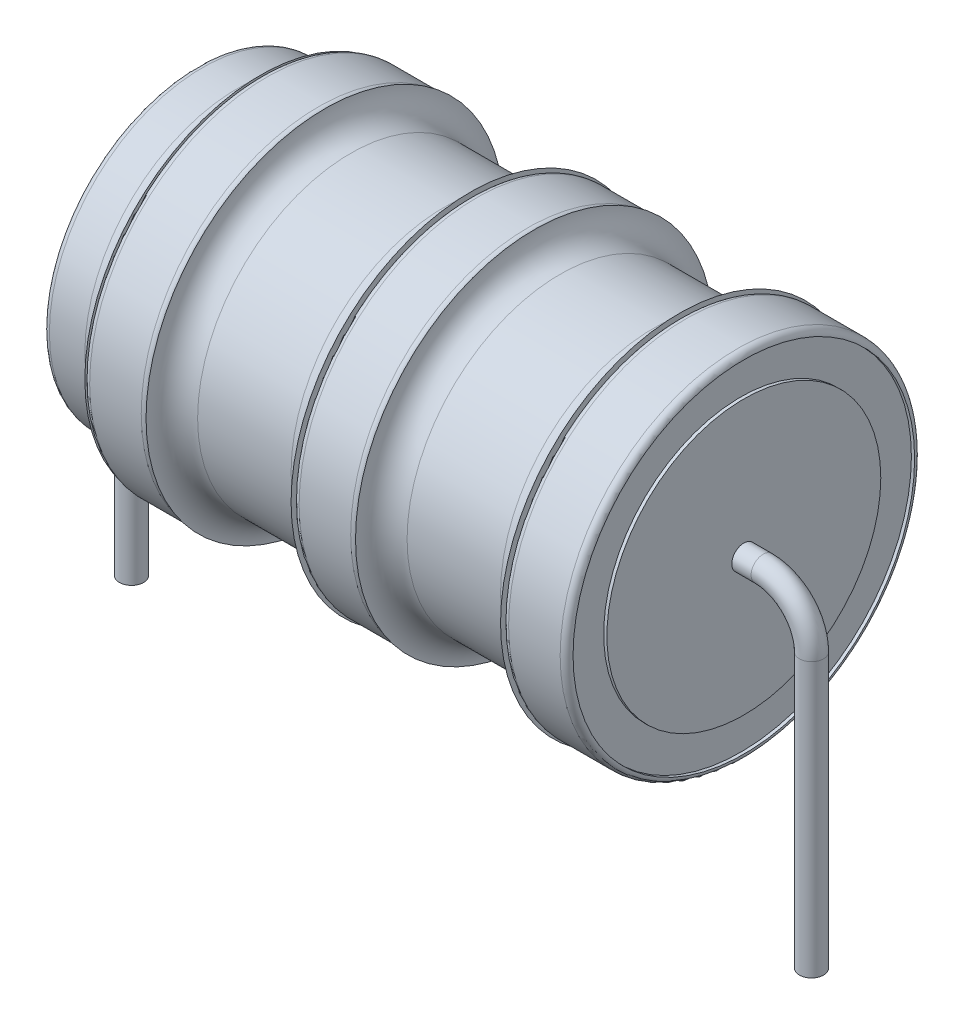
ISO-10303-21;
HEADER;
FILE_DESCRIPTION(('STEP AP214'),'2;1');
FILE_NAME('part.step','',(''),(''),'','','');
FILE_SCHEMA(('AUTOMOTIVE_DESIGN { 1 0 10303 214 1 1 1 1 }'));
ENDSEC;
DATA;
#1=APPLICATION_CONTEXT('core data for automotive mechanical design processes');
#2=APPLICATION_PROTOCOL_DEFINITION('international standard','automotive_design',2000,#1);
#3=PRODUCT_CONTEXT('',#1,'mechanical');
#4=PRODUCT('Part','Part','',(#3));
#5=PRODUCT_RELATED_PRODUCT_CATEGORY('part','',(#4));
#6=PRODUCT_DEFINITION_FORMATION('','',#4);
#7=PRODUCT_DEFINITION_CONTEXT('part definition',#1,'design');
#8=PRODUCT_DEFINITION('design','',#6,#7);
#9=PRODUCT_DEFINITION_SHAPE('','',#8);
#10=(LENGTH_UNIT() NAMED_UNIT(*) SI_UNIT(.MILLI.,.METRE.));
#11=(NAMED_UNIT(*) PLANE_ANGLE_UNIT() SI_UNIT($,.RADIAN.));
#12=(NAMED_UNIT(*) SI_UNIT($,.STERADIAN.) SOLID_ANGLE_UNIT());
#13=UNCERTAINTY_MEASURE_WITH_UNIT(LENGTH_MEASURE(1.E-05),#10,'distance_accuracy_value','');
#14=(GEOMETRIC_REPRESENTATION_CONTEXT(3) GLOBAL_UNCERTAINTY_ASSIGNED_CONTEXT((#13)) GLOBAL_UNIT_ASSIGNED_CONTEXT((#10,
#11,#12)) REPRESENTATION_CONTEXT('',''));
#15=CARTESIAN_POINT('',(0.,0.,0.));
#16=DIRECTION('',(0.,0.,1.));
#17=DIRECTION('',(1.,0.,0.));
#18=AXIS2_PLACEMENT_3D('',#15,#16,#17);
#19=CARTESIAN_POINT('',(16.8,0.,0.));
#20=DIRECTION('',(-1.,0.,0.));
#21=DIRECTION('',(0.,0.,1.));
#22=AXIS2_PLACEMENT_3D('',#19,#20,#21);
#23=TOROIDAL_SURFACE('',#22,5.3,0.199999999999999);
#24=CARTESIAN_POINT('',(16.8,0.,0.));
#25=DIRECTION('',(-1.,0.,0.));
#26=DIRECTION('',(0.,0.,1.));
#27=AXIS2_PLACEMENT_3D('',#24,#25,#26);
#28=CIRCLE('',#27,5.5);
#29=CARTESIAN_POINT('',(16.8,0.,5.5));
#30=VERTEX_POINT('',#29);
#31=EDGE_CURVE('E32',#30,#30,#28,.T.);
#32=ORIENTED_EDGE('',*,*,#31,.F.);
#33=EDGE_LOOP('',(#32));
#34=FACE_BOUND('',#33,.T.);
#35=CARTESIAN_POINT('',(17.,0.,0.));
#36=DIRECTION('',(1.,0.,0.));
#37=DIRECTION('',(0.,0.,-1.));
#38=AXIS2_PLACEMENT_3D('',#35,#36,#37);
#39=CIRCLE('',#38,5.3);
#40=CARTESIAN_POINT('',(17.,0.,-5.3));
#41=VERTEX_POINT('',#40);
#42=EDGE_CURVE('E60',#41,#41,#39,.T.);
#43=ORIENTED_EDGE('',*,*,#42,.F.);
#44=EDGE_LOOP('',(#43));
#45=FACE_BOUND('',#44,.T.);
#46=ADVANCED_FACE('F28',(#34,#45),#23,.T.);
#47=CARTESIAN_POINT('',(0.,0.,0.));
#48=DIRECTION('',(-1.,0.,0.));
#49=DIRECTION('',(0.,0.,1.));
#50=AXIS2_PLACEMENT_3D('',#47,#48,#49);
#51=CYLINDRICAL_SURFACE('',#50,5.5);
#52=CARTESIAN_POINT('',(15.2,0.,0.));
#53=DIRECTION('',(-1.,0.,0.));
#54=DIRECTION('',(0.,0.,1.));
#55=AXIS2_PLACEMENT_3D('',#52,#53,#54);
#56=CIRCLE('',#55,5.5);
#57=CARTESIAN_POINT('',(15.2,0.,5.5));
#58=VERTEX_POINT('',#57);
#59=EDGE_CURVE('E40',#58,#58,#56,.T.);
#60=ORIENTED_EDGE('',*,*,#59,.F.);
#61=EDGE_LOOP('',(#60));
#62=FACE_BOUND('',#61,.T.);
#63=ORIENTED_EDGE('',*,*,#31,.T.);
#64=EDGE_LOOP('',(#63));
#65=FACE_BOUND('',#64,.T.);
#66=ADVANCED_FACE('F139',(#62,#65),#51,.T.);
#67=CARTESIAN_POINT('',(15.2,0.,0.));
#68=DIRECTION('',(-1.,0.,0.));
#69=DIRECTION('',(0.,0.,1.));
#70=AXIS2_PLACEMENT_3D('',#67,#68,#69);
#71=TOROIDAL_SURFACE('',#70,5.3,0.2);
#72=CARTESIAN_POINT('',(15.,0.,0.));
#73=DIRECTION('',(-1.,0.,0.));
#74=DIRECTION('',(0.,0.,1.));
#75=AXIS2_PLACEMENT_3D('',#72,#73,#74);
#76=CIRCLE('',#75,5.3);
#77=CARTESIAN_POINT('',(15.,0.,5.3));
#78=VERTEX_POINT('',#77);
#79=EDGE_CURVE('E132',#78,#78,#76,.T.);
#80=ORIENTED_EDGE('',*,*,#79,.F.);
#81=EDGE_LOOP('',(#80));
#82=FACE_BOUND('',#81,.T.);
#83=ORIENTED_EDGE('',*,*,#59,.T.);
#84=EDGE_LOOP('',(#83));
#85=FACE_BOUND('',#84,.T.);
#86=ADVANCED_FACE('F137',(#82,#85),#71,.T.);
#87=CARTESIAN_POINT('',(15.,5.55,0.));
#88=DIRECTION('',(-1.,0.,0.));
#89=DIRECTION('',(0.,0.,1.));
#90=AXIS2_PLACEMENT_3D('',#87,#88,#89);
#91=PLANE('',#90);
#92=CARTESIAN_POINT('',(15.,0.,0.));
#93=DIRECTION('',(-1.,0.,0.));
#94=DIRECTION('',(0.,0.,1.));
#95=AXIS2_PLACEMENT_3D('',#92,#93,#94);
#96=CIRCLE('',#95,5.55);
#97=CARTESIAN_POINT('',(15.,0.,5.55));
#98=VERTEX_POINT('',#97);
#99=EDGE_CURVE('E129',#98,#98,#96,.T.);
#100=ORIENTED_EDGE('',*,*,#99,.F.);
#101=EDGE_LOOP('',(#100));
#102=FACE_BOUND('',#101,.T.);
#103=ORIENTED_EDGE('',*,*,#79,.T.);
#104=EDGE_LOOP('',(#103));
#105=FACE_BOUND('',#104,.T.);
#106=ADVANCED_FACE('F250',(#102,#105),#91,.F.);
#107=CARTESIAN_POINT('',(14.2,0.,0.));
#108=DIRECTION('',(-1.,0.,0.));
#109=DIRECTION('',(0.,0.,1.));
#110=AXIS2_PLACEMENT_3D('',#107,#108,#109);
#111=TOROIDAL_SURFACE('',#110,5.55,0.800000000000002);
#112=CARTESIAN_POINT('',(14.2,0.,0.));
#113=DIRECTION('',(-1.,0.,0.));
#114=DIRECTION('',(0.,0.,1.));
#115=AXIS2_PLACEMENT_3D('',#112,#113,#114);
#116=CIRCLE('',#115,4.75);
#117=CARTESIAN_POINT('',(14.2,0.,4.75));
#118=VERTEX_POINT('',#117);
#119=EDGE_CURVE('E126',#118,#118,#116,.T.);
#120=ORIENTED_EDGE('',*,*,#119,.F.);
#121=EDGE_LOOP('',(#120));
#122=FACE_BOUND('',#121,.T.);
#123=ORIENTED_EDGE('',*,*,#99,.T.);
#124=EDGE_LOOP('',(#123));
#125=FACE_BOUND('',#124,.T.);
#126=ADVANCED_FACE('F246',(#122,#125),#111,.F.);
#127=CARTESIAN_POINT('',(0.,0.,0.));
#128=DIRECTION('',(-1.,0.,0.));
#129=DIRECTION('',(0.,0.,1.));
#130=AXIS2_PLACEMENT_3D('',#127,#128,#129);
#131=CYLINDRICAL_SURFACE('',#130,4.75);
#132=CARTESIAN_POINT('',(11.3,0.,0.));
#133=DIRECTION('',(-1.,0.,0.));
#134=DIRECTION('',(0.,0.,1.));
#135=AXIS2_PLACEMENT_3D('',#132,#133,#134);
#136=CIRCLE('',#135,4.75);
#137=CARTESIAN_POINT('',(11.3,0.,4.75));
#138=VERTEX_POINT('',#137);
#139=EDGE_CURVE('E123',#138,#138,#136,.T.);
#140=ORIENTED_EDGE('',*,*,#139,.F.);
#141=EDGE_LOOP('',(#140));
#142=FACE_BOUND('',#141,.T.);
#143=ORIENTED_EDGE('',*,*,#119,.T.);
#144=EDGE_LOOP('',(#143));
#145=FACE_BOUND('',#144,.T.);
#146=ADVANCED_FACE('F242',(#142,#145),#131,.T.);
#147=CARTESIAN_POINT('',(11.3,0.,0.));
#148=DIRECTION('',(-1.,0.,0.));
#149=DIRECTION('',(0.,0.,1.));
#150=AXIS2_PLACEMENT_3D('',#147,#148,#149);
#151=TOROIDAL_SURFACE('',#150,5.55,0.8);
#152=CARTESIAN_POINT('',(10.5,0.,0.));
#153=DIRECTION('',(-1.,0.,0.));
#154=DIRECTION('',(0.,0.,1.));
#155=AXIS2_PLACEMENT_3D('',#152,#153,#154);
#156=CIRCLE('',#155,5.55);
#157=CARTESIAN_POINT('',(10.5,0.,5.55));
#158=VERTEX_POINT('',#157);
#159=EDGE_CURVE('E120',#158,#158,#156,.T.);
#160=ORIENTED_EDGE('',*,*,#159,.F.);
#161=EDGE_LOOP('',(#160));
#162=FACE_BOUND('',#161,.T.);
#163=ORIENTED_EDGE('',*,*,#139,.T.);
#164=EDGE_LOOP('',(#163));
#165=FACE_BOUND('',#164,.T.);
#166=ADVANCED_FACE('F238',(#162,#165),#151,.F.);
#167=CARTESIAN_POINT('',(10.5,5.3,0.));
#168=DIRECTION('',(1.,0.,0.));
#169=DIRECTION('',(0.,0.,-1.));
#170=AXIS2_PLACEMENT_3D('',#167,#168,#169);
#171=PLANE('',#170);
#172=CARTESIAN_POINT('',(10.5,0.,0.));
#173=DIRECTION('',(-1.,0.,0.));
#174=DIRECTION('',(0.,0.,1.));
#175=AXIS2_PLACEMENT_3D('',#172,#173,#174);
#176=CIRCLE('',#175,5.3);
#177=CARTESIAN_POINT('',(10.5,0.,5.3));
#178=VERTEX_POINT('',#177);
#179=EDGE_CURVE('E117',#178,#178,#176,.T.);
#180=ORIENTED_EDGE('',*,*,#179,.F.);
#181=EDGE_LOOP('',(#180));
#182=FACE_BOUND('',#181,.T.);
#183=ORIENTED_EDGE('',*,*,#159,.T.);
#184=EDGE_LOOP('',(#183));
#185=FACE_BOUND('',#184,.T.);
#186=ADVANCED_FACE('F234',(#182,#185),#171,.F.);
#187=CARTESIAN_POINT('',(10.3,0.,0.));
#188=DIRECTION('',(-1.,0.,0.));
#189=DIRECTION('',(0.,0.,1.));
#190=AXIS2_PLACEMENT_3D('',#187,#188,#189);
#191=TOROIDAL_SURFACE('',#190,5.3,0.199999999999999);
#192=CARTESIAN_POINT('',(10.3,0.,0.));
#193=DIRECTION('',(-1.,0.,0.));
#194=DIRECTION('',(0.,0.,1.));
#195=AXIS2_PLACEMENT_3D('',#192,#193,#194);
#196=CIRCLE('',#195,5.5);
#197=CARTESIAN_POINT('',(10.3,0.,5.5));
#198=VERTEX_POINT('',#197);
#199=EDGE_CURVE('E114',#198,#198,#196,.T.);
#200=ORIENTED_EDGE('',*,*,#199,.F.);
#201=EDGE_LOOP('',(#200));
#202=FACE_BOUND('',#201,.T.);
#203=ORIENTED_EDGE('',*,*,#179,.T.);
#204=EDGE_LOOP('',(#203));
#205=FACE_BOUND('',#204,.T.);
#206=ADVANCED_FACE('F230',(#202,#205),#191,.T.);
#207=CARTESIAN_POINT('',(0.,0.,0.));
#208=DIRECTION('',(-1.,0.,0.));
#209=DIRECTION('',(0.,0.,1.));
#210=AXIS2_PLACEMENT_3D('',#207,#208,#209);
#211=CYLINDRICAL_SURFACE('',#210,5.5);
#212=CARTESIAN_POINT('',(8.7,0.,0.));
#213=DIRECTION('',(-1.,0.,0.));
#214=DIRECTION('',(0.,0.,1.));
#215=AXIS2_PLACEMENT_3D('',#212,#213,#214);
#216=CIRCLE('',#215,5.5);
#217=CARTESIAN_POINT('',(8.7,0.,5.5));
#218=VERTEX_POINT('',#217);
#219=EDGE_CURVE('E111',#218,#218,#216,.T.);
#220=ORIENTED_EDGE('',*,*,#219,.F.);
#221=EDGE_LOOP('',(#220));
#222=FACE_BOUND('',#221,.T.);
#223=ORIENTED_EDGE('',*,*,#199,.T.);
#224=EDGE_LOOP('',(#223));
#225=FACE_BOUND('',#224,.T.);
#226=ADVANCED_FACE('F226',(#222,#225),#211,.T.);
#227=CARTESIAN_POINT('',(8.7,0.,0.));
#228=DIRECTION('',(-1.,0.,0.));
#229=DIRECTION('',(0.,0.,1.));
#230=AXIS2_PLACEMENT_3D('',#227,#228,#229);
#231=TOROIDAL_SURFACE('',#230,5.3,0.2);
#232=CARTESIAN_POINT('',(8.5,0.,0.));
#233=DIRECTION('',(-1.,0.,0.));
#234=DIRECTION('',(0.,0.,1.));
#235=AXIS2_PLACEMENT_3D('',#232,#233,#234);
#236=CIRCLE('',#235,5.3);
#237=CARTESIAN_POINT('',(8.5,0.,5.3));
#238=VERTEX_POINT('',#237);
#239=EDGE_CURVE('E108',#238,#238,#236,.T.);
#240=ORIENTED_EDGE('',*,*,#239,.F.);
#241=EDGE_LOOP('',(#240));
#242=FACE_BOUND('',#241,.T.);
#243=ORIENTED_EDGE('',*,*,#219,.T.);
#244=EDGE_LOOP('',(#243));
#245=FACE_BOUND('',#244,.T.);
#246=ADVANCED_FACE('F222',(#242,#245),#231,.T.);
#247=CARTESIAN_POINT('',(8.5,5.55,0.));
#248=DIRECTION('',(-1.,0.,0.));
#249=DIRECTION('',(0.,0.,1.));
#250=AXIS2_PLACEMENT_3D('',#247,#248,#249);
#251=PLANE('',#250);
#252=CARTESIAN_POINT('',(8.5,0.,0.));
#253=DIRECTION('',(-1.,0.,0.));
#254=DIRECTION('',(0.,0.,1.));
#255=AXIS2_PLACEMENT_3D('',#252,#253,#254);
#256=CIRCLE('',#255,5.55);
#257=CARTESIAN_POINT('',(8.5,0.,5.55));
#258=VERTEX_POINT('',#257);
#259=EDGE_CURVE('E105',#258,#258,#256,.T.);
#260=ORIENTED_EDGE('',*,*,#259,.F.);
#261=EDGE_LOOP('',(#260));
#262=FACE_BOUND('',#261,.T.);
#263=ORIENTED_EDGE('',*,*,#239,.T.);
#264=EDGE_LOOP('',(#263));
#265=FACE_BOUND('',#264,.T.);
#266=ADVANCED_FACE('F218',(#262,#265),#251,.F.);
#267=CARTESIAN_POINT('',(7.7,0.,0.));
#268=DIRECTION('',(-1.,0.,0.));
#269=DIRECTION('',(0.,0.,1.));
#270=AXIS2_PLACEMENT_3D('',#267,#268,#269);
#271=TOROIDAL_SURFACE('',#270,5.55,0.8);
#272=CARTESIAN_POINT('',(7.7,0.,0.));
#273=DIRECTION('',(-1.,0.,0.));
#274=DIRECTION('',(0.,0.,1.));
#275=AXIS2_PLACEMENT_3D('',#272,#273,#274);
#276=CIRCLE('',#275,4.75);
#277=CARTESIAN_POINT('',(7.7,0.,4.75));
#278=VERTEX_POINT('',#277);
#279=EDGE_CURVE('E102',#278,#278,#276,.T.);
#280=ORIENTED_EDGE('',*,*,#279,.F.);
#281=EDGE_LOOP('',(#280));
#282=FACE_BOUND('',#281,.T.);
#283=ORIENTED_EDGE('',*,*,#259,.T.);
#284=EDGE_LOOP('',(#283));
#285=FACE_BOUND('',#284,.T.);
#286=ADVANCED_FACE('F214',(#282,#285),#271,.F.);
#287=CARTESIAN_POINT('',(0.,0.,0.));
#288=DIRECTION('',(-1.,0.,0.));
#289=DIRECTION('',(0.,0.,1.));
#290=AXIS2_PLACEMENT_3D('',#287,#288,#289);
#291=CYLINDRICAL_SURFACE('',#290,4.75);
#292=CARTESIAN_POINT('',(4.8,0.,0.));
#293=DIRECTION('',(-1.,0.,0.));
#294=DIRECTION('',(0.,0.,1.));
#295=AXIS2_PLACEMENT_3D('',#292,#293,#294);
#296=CIRCLE('',#295,4.75);
#297=CARTESIAN_POINT('',(4.8,0.,4.75));
#298=VERTEX_POINT('',#297);
#299=EDGE_CURVE('E99',#298,#298,#296,.T.);
#300=ORIENTED_EDGE('',*,*,#299,.F.);
#301=EDGE_LOOP('',(#300));
#302=FACE_BOUND('',#301,.T.);
#303=ORIENTED_EDGE('',*,*,#279,.T.);
#304=EDGE_LOOP('',(#303));
#305=FACE_BOUND('',#304,.T.);
#306=ADVANCED_FACE('F210',(#302,#305),#291,.T.);
#307=CARTESIAN_POINT('',(4.8,0.,0.));
#308=DIRECTION('',(-1.,0.,0.));
#309=DIRECTION('',(0.,0.,1.));
#310=AXIS2_PLACEMENT_3D('',#307,#308,#309);
#311=TOROIDAL_SURFACE('',#310,5.55,0.8);
#312=CARTESIAN_POINT('',(4.,0.,0.));
#313=DIRECTION('',(-1.,0.,0.));
#314=DIRECTION('',(0.,0.,1.));
#315=AXIS2_PLACEMENT_3D('',#312,#313,#314);
#316=CIRCLE('',#315,5.55);
#317=CARTESIAN_POINT('',(4.,0.,5.55));
#318=VERTEX_POINT('',#317);
#319=EDGE_CURVE('E96',#318,#318,#316,.T.);
#320=ORIENTED_EDGE('',*,*,#319,.F.);
#321=EDGE_LOOP('',(#320));
#322=FACE_BOUND('',#321,.T.);
#323=ORIENTED_EDGE('',*,*,#299,.T.);
#324=EDGE_LOOP('',(#323));
#325=FACE_BOUND('',#324,.T.);
#326=ADVANCED_FACE('F206',(#322,#325),#311,.F.);
#327=CARTESIAN_POINT('',(4.,5.3,0.));
#328=DIRECTION('',(1.,0.,0.));
#329=DIRECTION('',(0.,0.,-1.));
#330=AXIS2_PLACEMENT_3D('',#327,#328,#329);
#331=PLANE('',#330);
#332=CARTESIAN_POINT('',(4.,0.,0.));
#333=DIRECTION('',(-1.,0.,0.));
#334=DIRECTION('',(0.,0.,1.));
#335=AXIS2_PLACEMENT_3D('',#332,#333,#334);
#336=CIRCLE('',#335,5.3);
#337=CARTESIAN_POINT('',(4.,0.,5.3));
#338=VERTEX_POINT('',#337);
#339=EDGE_CURVE('E93',#338,#338,#336,.T.);
#340=ORIENTED_EDGE('',*,*,#339,.F.);
#341=EDGE_LOOP('',(#340));
#342=FACE_BOUND('',#341,.T.);
#343=ORIENTED_EDGE('',*,*,#319,.T.);
#344=EDGE_LOOP('',(#343));
#345=FACE_BOUND('',#344,.T.);
#346=ADVANCED_FACE('F202',(#342,#345),#331,.F.);
#347=CARTESIAN_POINT('',(3.8,0.,0.));
#348=DIRECTION('',(-1.,0.,0.));
#349=DIRECTION('',(0.,0.,1.));
#350=AXIS2_PLACEMENT_3D('',#347,#348,#349);
#351=TOROIDAL_SURFACE('',#350,5.3,0.2);
#352=CARTESIAN_POINT('',(3.8,0.,0.));
#353=DIRECTION('',(-1.,0.,0.));
#354=DIRECTION('',(0.,0.,1.));
#355=AXIS2_PLACEMENT_3D('',#352,#353,#354);
#356=CIRCLE('',#355,5.5);
#357=CARTESIAN_POINT('',(3.8,0.,5.5));
#358=VERTEX_POINT('',#357);
#359=EDGE_CURVE('E90',#358,#358,#356,.T.);
#360=ORIENTED_EDGE('',*,*,#359,.F.);
#361=EDGE_LOOP('',(#360));
#362=FACE_BOUND('',#361,.T.);
#363=ORIENTED_EDGE('',*,*,#339,.T.);
#364=EDGE_LOOP('',(#363));
#365=FACE_BOUND('',#364,.T.);
#366=ADVANCED_FACE('F198',(#362,#365),#351,.T.);
#367=CARTESIAN_POINT('',(0.,0.,0.));
#368=DIRECTION('',(-1.,0.,0.));
#369=DIRECTION('',(0.,0.,1.));
#370=AXIS2_PLACEMENT_3D('',#367,#368,#369);
#371=CYLINDRICAL_SURFACE('',#370,5.5);
#372=CARTESIAN_POINT('',(2.2,0.,0.));
#373=DIRECTION('',(-1.,0.,0.));
#374=DIRECTION('',(0.,0.,1.));
#375=AXIS2_PLACEMENT_3D('',#372,#373,#374);
#376=CIRCLE('',#375,5.5);
#377=CARTESIAN_POINT('',(2.2,0.,5.5));
#378=VERTEX_POINT('',#377);
#379=EDGE_CURVE('E87',#378,#378,#376,.T.);
#380=ORIENTED_EDGE('',*,*,#379,.F.);
#381=EDGE_LOOP('',(#380));
#382=FACE_BOUND('',#381,.T.);
#383=ORIENTED_EDGE('',*,*,#359,.T.);
#384=EDGE_LOOP('',(#383));
#385=FACE_BOUND('',#384,.T.);
#386=ADVANCED_FACE('F194',(#382,#385),#371,.T.);
#387=CARTESIAN_POINT('',(2.2,0.,0.));
#388=DIRECTION('',(-1.,0.,0.));
#389=DIRECTION('',(0.,0.,1.));
#390=AXIS2_PLACEMENT_3D('',#387,#388,#389);
#391=TOROIDAL_SURFACE('',#390,5.3,0.2);
#392=CARTESIAN_POINT('',(2.,0.,0.));
#393=DIRECTION('',(-1.,0.,0.));
#394=DIRECTION('',(0.,0.,1.));
#395=AXIS2_PLACEMENT_3D('',#392,#393,#394);
#396=CIRCLE('',#395,5.3);
#397=CARTESIAN_POINT('',(2.,0.,5.3));
#398=VERTEX_POINT('',#397);
#399=EDGE_CURVE('E84',#398,#398,#396,.T.);
#400=ORIENTED_EDGE('',*,*,#399,.F.);
#401=EDGE_LOOP('',(#400));
#402=FACE_BOUND('',#401,.T.);
#403=ORIENTED_EDGE('',*,*,#379,.T.);
#404=EDGE_LOOP('',(#403));
#405=FACE_BOUND('',#404,.T.);
#406=ADVANCED_FACE('F190',(#402,#405),#391,.T.);
#407=CARTESIAN_POINT('',(2.,5.45,0.));
#408=DIRECTION('',(-1.,0.,0.));
#409=DIRECTION('',(0.,0.,1.));
#410=AXIS2_PLACEMENT_3D('',#407,#408,#409);
#411=PLANE('',#410);
#412=CARTESIAN_POINT('',(2.,0.,0.));
#413=DIRECTION('',(-1.,0.,0.));
#414=DIRECTION('',(0.,0.,1.));
#415=AXIS2_PLACEMENT_3D('',#412,#413,#414);
#416=CIRCLE('',#415,5.45);
#417=CARTESIAN_POINT('',(2.,0.,5.45));
#418=VERTEX_POINT('',#417);
#419=EDGE_CURVE('E81',#418,#418,#416,.T.);
#420=ORIENTED_EDGE('',*,*,#419,.F.);
#421=EDGE_LOOP('',(#420));
#422=FACE_BOUND('',#421,.T.);
#423=ORIENTED_EDGE('',*,*,#399,.T.);
#424=EDGE_LOOP('',(#423));
#425=FACE_BOUND('',#424,.T.);
#426=ADVANCED_FACE('F186',(#422,#425),#411,.F.);
#427=CARTESIAN_POINT('',(1.3,0.,0.));
#428=DIRECTION('',(-1.,0.,0.));
#429=DIRECTION('',(0.,0.,1.));
#430=AXIS2_PLACEMENT_3D('',#427,#428,#429);
#431=TOROIDAL_SURFACE('',#430,5.45,0.7);
#432=CARTESIAN_POINT('',(1.3,0.,0.));
#433=DIRECTION('',(-1.,0.,0.));
#434=DIRECTION('',(0.,0.,1.));
#435=AXIS2_PLACEMENT_3D('',#432,#433,#434);
#436=CIRCLE('',#435,4.75);
#437=CARTESIAN_POINT('',(1.3,0.,4.75));
#438=VERTEX_POINT('',#437);
#439=EDGE_CURVE('E78',#438,#438,#436,.T.);
#440=ORIENTED_EDGE('',*,*,#439,.F.);
#441=EDGE_LOOP('',(#440));
#442=FACE_BOUND('',#441,.T.);
#443=ORIENTED_EDGE('',*,*,#419,.T.);
#444=EDGE_LOOP('',(#443));
#445=FACE_BOUND('',#444,.T.);
#446=ADVANCED_FACE('F182',(#442,#445),#431,.F.);
#447=CARTESIAN_POINT('',(0.,0.,0.));
#448=DIRECTION('',(-1.,0.,0.));
#449=DIRECTION('',(0.,0.,1.));
#450=AXIS2_PLACEMENT_3D('',#447,#448,#449);
#451=CYLINDRICAL_SURFACE('',#450,4.75);
#452=CARTESIAN_POINT('',(0.2,0.,0.));
#453=DIRECTION('',(-1.,0.,0.));
#454=DIRECTION('',(0.,0.,1.));
#455=AXIS2_PLACEMENT_3D('',#452,#453,#454);
#456=CIRCLE('',#455,4.75);
#457=CARTESIAN_POINT('',(0.2,0.,4.75));
#458=VERTEX_POINT('',#457);
#459=EDGE_CURVE('E75',#458,#458,#456,.T.);
#460=ORIENTED_EDGE('',*,*,#459,.F.);
#461=EDGE_LOOP('',(#460));
#462=FACE_BOUND('',#461,.T.);
#463=ORIENTED_EDGE('',*,*,#439,.T.);
#464=EDGE_LOOP('',(#463));
#465=FACE_BOUND('',#464,.T.);
#466=ADVANCED_FACE('F178',(#462,#465),#451,.T.);
#467=CARTESIAN_POINT('',(0.2,0.,0.));
#468=DIRECTION('',(-1.,0.,0.));
#469=DIRECTION('',(0.,0.,1.));
#470=AXIS2_PLACEMENT_3D('',#467,#468,#469);
#471=TOROIDAL_SURFACE('',#470,4.55,0.2);
#472=CARTESIAN_POINT('',(0.,0.,0.));
#473=DIRECTION('',(-1.,0.,0.));
#474=DIRECTION('',(0.,0.,1.));
#475=AXIS2_PLACEMENT_3D('',#472,#473,#474);
#476=CIRCLE('',#475,4.55);
#477=CARTESIAN_POINT('',(0.,0.,4.55));
#478=VERTEX_POINT('',#477);
#479=EDGE_CURVE('E72',#478,#478,#476,.T.);
#480=ORIENTED_EDGE('',*,*,#479,.F.);
#481=EDGE_LOOP('',(#480));
#482=FACE_BOUND('',#481,.T.);
#483=ORIENTED_EDGE('',*,*,#459,.T.);
#484=EDGE_LOOP('',(#483));
#485=FACE_BOUND('',#484,.T.);
#486=ADVANCED_FACE('F174',(#482,#485),#471,.T.);
#487=CARTESIAN_POINT('',(0.,0.,0.));
#488=DIRECTION('',(1.,0.,0.));
#489=DIRECTION('',(0.,0.,-1.));
#490=AXIS2_PLACEMENT_3D('',#487,#488,#489);
#491=PLANE('',#490);
#492=CARTESIAN_POINT('',(0.,0.,0.));
#493=DIRECTION('',(-1.,0.,0.));
#494=DIRECTION('',(0.,0.,1.));
#495=AXIS2_PLACEMENT_3D('',#492,#493,#494);
#496=CIRCLE('',#495,4.25);
#497=CARTESIAN_POINT('',(0.,0.,4.25));
#498=VERTEX_POINT('',#497);
#499=EDGE_CURVE('E66',#498,#498,#496,.T.);
#500=ORIENTED_EDGE('',*,*,#499,.F.);
#501=EDGE_LOOP('',(#500));
#502=FACE_BOUND('',#501,.T.);
#503=ORIENTED_EDGE('',*,*,#479,.T.);
#504=EDGE_LOOP('',(#503));
#505=FACE_BOUND('',#504,.T.);
#506=ADVANCED_FACE('F170',(#502,#505),#491,.F.);
#507=CARTESIAN_POINT('',(0.1,0.,0.));
#508=DIRECTION('',(-1.,0.,0.));
#509=DIRECTION('',(0.,0.,1.));
#510=AXIS2_PLACEMENT_3D('',#507,#508,#509);
#511=CYLINDRICAL_SURFACE('',#510,4.25);
#512=CARTESIAN_POINT('',(0.1,0.,0.));
#513=DIRECTION('',(-1.,0.,0.));
#514=DIRECTION('',(0.,0.,1.));
#515=AXIS2_PLACEMENT_3D('',#512,#513,#514);
#516=CIRCLE('',#515,4.25);
#517=CARTESIAN_POINT('',(0.1,0.,4.25));
#518=VERTEX_POINT('',#517);
#519=EDGE_CURVE('E69',#518,#518,#516,.T.);
#520=ORIENTED_EDGE('',*,*,#519,.F.);
#521=EDGE_LOOP('',(#520));
#522=FACE_BOUND('',#521,.T.);
#523=ORIENTED_EDGE('',*,*,#499,.T.);
#524=EDGE_LOOP('',(#523));
#525=FACE_BOUND('',#524,.T.);
#526=ADVANCED_FACE('F162',(#522,#525),#511,.F.);
#527=CARTESIAN_POINT('',(0.1,0.,0.));
#528=DIRECTION('',(-1.,0.,0.));
#529=DIRECTION('',(0.,0.,1.));
#530=AXIS2_PLACEMENT_3D('',#527,#528,#529);
#531=PLANE('',#530);
#532=CARTESIAN_POINT('',(0.1,0.,0.));
#533=DIRECTION('',(-1.,0.,0.));
#534=DIRECTION('',(0.,0.,1.));
#535=AXIS2_PLACEMENT_3D('',#532,#533,#534);
#536=CIRCLE('',#535,0.375);
#537=CARTESIAN_POINT('',(0.1,0.,0.375));
#538=VERTEX_POINT('',#537);
#539=EDGE_CURVE('E10',#538,#538,#536,.T.);
#540=ORIENTED_EDGE('',*,*,#539,.F.);
#541=EDGE_LOOP('',(#540));
#542=FACE_BOUND('',#541,.T.);
#543=ORIENTED_EDGE('',*,*,#519,.T.);
#544=EDGE_LOOP('',(#543));
#545=FACE_BOUND('',#544,.T.);
#546=ADVANCED_FACE('F152',(#542,#545),#531,.T.);
#547=CARTESIAN_POINT('',(16.9,0.,0.));
#548=DIRECTION('',(1.,0.,0.));
#549=DIRECTION('',(0.,0.,-1.));
#550=AXIS2_PLACEMENT_3D('',#547,#548,#549);
#551=CYLINDRICAL_SURFACE('',#550,5.3);
#552=CARTESIAN_POINT('',(16.9,0.,0.));
#553=DIRECTION('',(1.,0.,0.));
#554=DIRECTION('',(0.,0.,-1.));
#555=AXIS2_PLACEMENT_3D('',#552,#553,#554);
#556=CIRCLE('',#555,5.3);
#557=CARTESIAN_POINT('',(16.9,0.,-5.3));
#558=VERTEX_POINT('',#557);
#559=EDGE_CURVE('E63',#558,#558,#556,.T.);
#560=ORIENTED_EDGE('',*,*,#559,.F.);
#561=EDGE_LOOP('',(#560));
#562=FACE_BOUND('',#561,.T.);
#563=ORIENTED_EDGE('',*,*,#42,.T.);
#564=EDGE_LOOP('',(#563));
#565=FACE_BOUND('',#564,.T.);
#566=ADVANCED_FACE('F149',(#562,#565),#551,.F.);
#567=CARTESIAN_POINT('',(16.9,0.,0.));
#568=DIRECTION('',(1.,0.,0.));
#569=DIRECTION('',(0.,0.,-1.));
#570=AXIS2_PLACEMENT_3D('',#567,#568,#569);
#571=PLANE('',#570);
#572=CARTESIAN_POINT('',(16.9,0.,0.));
#573=DIRECTION('',(1.,0.,0.));
#574=DIRECTION('',(0.,0.,-1.));
#575=AXIS2_PLACEMENT_3D('',#572,#573,#574);
#576=CIRCLE('',#575,4.25);
#577=CARTESIAN_POINT('',(16.9,0.,-4.25));
#578=VERTEX_POINT('',#577);
#579=EDGE_CURVE('E57',#578,#578,#576,.T.);
#580=ORIENTED_EDGE('',*,*,#579,.F.);
#581=EDGE_LOOP('',(#580));
#582=FACE_BOUND('',#581,.T.);
#583=ORIENTED_EDGE('',*,*,#559,.T.);
#584=EDGE_LOOP('',(#583));
#585=FACE_BOUND('',#584,.T.);
#586=ADVANCED_FACE('F151',(#582,#585),#571,.T.);
#587=CARTESIAN_POINT('',(16.9,0.,0.));
#588=DIRECTION('',(1.,0.,0.));
#589=DIRECTION('',(0.,0.,-1.));
#590=AXIS2_PLACEMENT_3D('',#587,#588,#589);
#591=CYLINDRICAL_SURFACE('',#590,4.25);
#592=ORIENTED_EDGE('',*,*,#579,.T.);
#593=EDGE_LOOP('',(#592));
#594=FACE_BOUND('',#593,.T.);
#595=CARTESIAN_POINT('',(17.,0.,0.));
#596=DIRECTION('',(1.,0.,0.));
#597=DIRECTION('',(0.,0.,-1.));
#598=AXIS2_PLACEMENT_3D('',#595,#596,#597);
#599=CIRCLE('',#598,4.25);
#600=CARTESIAN_POINT('',(17.,0.,-4.25));
#601=VERTEX_POINT('',#600);
#602=EDGE_CURVE('E54',#601,#601,#599,.T.);
#603=ORIENTED_EDGE('',*,*,#602,.F.);
#604=EDGE_LOOP('',(#603));
#605=FACE_BOUND('',#604,.T.);
#606=ADVANCED_FACE('F159',(#594,#605),#591,.T.);
#607=CARTESIAN_POINT('',(17.,5.3,0.));
#608=DIRECTION('',(-1.,0.,0.));
#609=DIRECTION('',(0.,0.,1.));
#610=AXIS2_PLACEMENT_3D('',#607,#608,#609);
#611=PLANE('',#610);
#612=CARTESIAN_POINT('',(17.,0.,0.));
#613=DIRECTION('',(-1.,0.,0.));
#614=DIRECTION('',(0.,0.,1.));
#615=AXIS2_PLACEMENT_3D('',#612,#613,#614);
#616=CIRCLE('',#615,0.375);
#617=CARTESIAN_POINT('',(17.,0.,0.375));
#618=VERTEX_POINT('',#617);
#619=EDGE_CURVE('E480',#618,#618,#616,.T.);
#620=ORIENTED_EDGE('',*,*,#619,.T.);
#621=EDGE_LOOP('',(#620));
#622=FACE_BOUND('',#621,.T.);
#623=ORIENTED_EDGE('',*,*,#602,.T.);
#624=EDGE_LOOP('',(#623));
#625=FACE_BOUND('',#624,.T.);
#626=ADVANCED_FACE('F30',(#622,#625),#611,.F.);
#627=CARTESIAN_POINT('',(-2.,-1.50000000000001,0.));
#628=DIRECTION('',(0.,-1.,0.));
#629=DIRECTION('',(1.,0.,0.));
#630=AXIS2_PLACEMENT_3D('',#627,#628,#629);
#631=CYLINDRICAL_SURFACE('',#630,0.375);
#632=CARTESIAN_POINT('',(-2.,-1.50000000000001,0.));
#633=DIRECTION('',(0.,-1.,0.));
#634=DIRECTION('',(0.,0.,1.));
#635=AXIS2_PLACEMENT_3D('',#632,#633,#634);
#636=CIRCLE('',#635,0.375);
#637=CARTESIAN_POINT('',(-2.375,-1.50000000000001,0.));
#638=VERTEX_POINT('',#637);
#639=EDGE_CURVE('E48',#638,#638,#636,.T.);
#640=ORIENTED_EDGE('',*,*,#639,.T.);
#641=EDGE_LOOP('',(#640));
#642=FACE_BOUND('',#641,.T.);
#643=CARTESIAN_POINT('',(-2.,-10.,0.));
#644=DIRECTION('',(0.,-1.,0.));
#645=DIRECTION('',(0.,0.,1.));
#646=AXIS2_PLACEMENT_3D('',#643,#644,#645);
#647=CIRCLE('',#646,0.375);
#648=CARTESIAN_POINT('',(-2.,-10.,0.375));
#649=VERTEX_POINT('',#648);
#650=EDGE_CURVE('E51',#649,#649,#647,.T.);
#651=ORIENTED_EDGE('',*,*,#650,.F.);
#652=EDGE_LOOP('',(#651));
#653=FACE_BOUND('',#652,.T.);
#654=ADVANCED_FACE('F366',(#642,#653),#631,.T.);
#655=CARTESIAN_POINT('',(-0.5,-1.5,0.));
#656=DIRECTION('',(0.,0.,1.));
#657=DIRECTION('',(1.,0.,0.));
#658=AXIS2_PLACEMENT_3D('',#655,#656,#657);
#659=TOROIDAL_SURFACE('',#658,1.5,0.375);
#660=CARTESIAN_POINT('',(-0.499999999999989,0.,0.));
#661=DIRECTION('',(-1.,0.,0.));
#662=DIRECTION('',(0.,0.,1.));
#663=AXIS2_PLACEMENT_3D('',#660,#661,#662);
#664=CIRCLE('',#663,0.375);
#665=CARTESIAN_POINT('',(-0.499999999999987,0.375,0.));
#666=VERTEX_POINT('',#665);
#667=EDGE_CURVE('E45',#666,#666,#664,.T.);
#668=CARTESIAN_POINT('',(-0.5,-1.5,0.));
#669=DIRECTION('',(0.,0.,1.));
#670=DIRECTION('',(1.,0.,0.));
#671=AXIS2_PLACEMENT_3D('',#668,#669,#670);
#672=CIRCLE('',#671,1.875);
#673=EDGE_CURVE('',#666,#638,#672,.T.);
#674=ORIENTED_EDGE('',*,*,#667,.T.);
#675=ORIENTED_EDGE('',*,*,#639,.F.);
#676=ORIENTED_EDGE('',*,*,#673,.T.);
#677=ORIENTED_EDGE('',*,*,#673,.F.);
#678=EDGE_LOOP('',(#674,#676,#675,#677));
#679=FACE_BOUND('',#678,.T.);
#680=ADVANCED_FACE('F371',(#679),#659,.T.);
#681=CARTESIAN_POINT('',(0.,0.,0.));
#682=DIRECTION('',(1.,0.,0.));
#683=DIRECTION('',(0.,1.,0.));
#684=AXIS2_PLACEMENT_3D('',#681,#682,#683);
#685=CYLINDRICAL_SURFACE('',#684,0.375);
#686=ORIENTED_EDGE('',*,*,#539,.T.);
#687=EDGE_LOOP('',(#686));
#688=FACE_BOUND('',#687,.T.);
#689=ORIENTED_EDGE('',*,*,#667,.F.);
#690=EDGE_LOOP('',(#689));
#691=FACE_BOUND('',#690,.T.);
#692=ADVANCED_FACE('F382',(#688,#691),#685,.T.);
#693=CARTESIAN_POINT('',(-2.,-10.,0.));
#694=DIRECTION('',(0.,-1.,0.));
#695=DIRECTION('',(0.,0.,1.));
#696=AXIS2_PLACEMENT_3D('',#693,#694,#695);
#697=PLANE('',#696);
#698=ORIENTED_EDGE('',*,*,#650,.T.);
#699=EDGE_LOOP('',(#698));
#700=FACE_BOUND('',#699,.T.);
#701=ADVANCED_FACE('F393',(#700),#697,.T.);
#702=CARTESIAN_POINT('',(19.1,-1.50000000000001,0.));
#703=DIRECTION('',(0.,-1.,0.));
#704=DIRECTION('',(1.,0.,0.));
#705=AXIS2_PLACEMENT_3D('',#702,#703,#704);
#706=CYLINDRICAL_SURFACE('',#705,0.375);
#707=CARTESIAN_POINT('',(19.1,-1.50000000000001,0.));
#708=DIRECTION('',(0.,1.,0.));
#709=DIRECTION('',(0.,0.,1.));
#710=AXIS2_PLACEMENT_3D('',#707,#708,#709);
#711=CIRCLE('',#710,0.375);
#712=CARTESIAN_POINT('',(19.475,-1.50000000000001,0.));
#713=VERTEX_POINT('',#712);
#714=EDGE_CURVE('E474',#713,#713,#711,.T.);
#715=ORIENTED_EDGE('',*,*,#714,.F.);
#716=EDGE_LOOP('',(#715));
#717=FACE_BOUND('',#716,.T.);
#718=CARTESIAN_POINT('',(19.1,-10.,0.));
#719=DIRECTION('',(0.,1.,0.));
#720=DIRECTION('',(0.,0.,1.));
#721=AXIS2_PLACEMENT_3D('',#718,#719,#720);
#722=CIRCLE('',#721,0.375);
#723=CARTESIAN_POINT('',(19.1,-10.,0.375));
#724=VERTEX_POINT('',#723);
#725=EDGE_CURVE('E43',#724,#724,#722,.T.);
#726=ORIENTED_EDGE('',*,*,#725,.T.);
#727=EDGE_LOOP('',(#726));
#728=FACE_BOUND('',#727,.T.);
#729=ADVANCED_FACE('F402',(#717,#728),#706,.T.);
#730=CARTESIAN_POINT('',(17.6,-1.5,0.));
#731=DIRECTION('',(0.,0.,-1.));
#732=DIRECTION('',(-1.,0.,0.));
#733=AXIS2_PLACEMENT_3D('',#730,#731,#732);
#734=TOROIDAL_SURFACE('',#733,1.5,0.375);
#735=CARTESIAN_POINT('',(17.6,0.,0.));
#736=DIRECTION('',(-1.,0.,0.));
#737=DIRECTION('',(0.,0.,1.));
#738=AXIS2_PLACEMENT_3D('',#735,#736,#737);
#739=CIRCLE('',#738,0.375);
#740=CARTESIAN_POINT('',(17.6,0.375,0.));
#741=VERTEX_POINT('',#740);
#742=EDGE_CURVE('E476',#741,#741,#739,.T.);
#743=CARTESIAN_POINT('',(17.6,-1.5,0.));
#744=DIRECTION('',(0.,0.,-1.));
#745=DIRECTION('',(-1.,0.,0.));
#746=AXIS2_PLACEMENT_3D('',#743,#744,#745);
#747=CIRCLE('',#746,1.875);
#748=EDGE_CURVE('',#741,#713,#747,.T.);
#749=ORIENTED_EDGE('',*,*,#742,.F.);
#750=ORIENTED_EDGE('',*,*,#714,.T.);
#751=ORIENTED_EDGE('',*,*,#748,.T.);
#752=ORIENTED_EDGE('',*,*,#748,.F.);
#753=EDGE_LOOP('',(#749,#751,#750,#752));
#754=FACE_BOUND('',#753,.T.);
#755=ADVANCED_FACE('F419',(#754),#734,.T.);
#756=CARTESIAN_POINT('',(17.1,0.,0.));
#757=DIRECTION('',(-1.,0.,0.));
#758=DIRECTION('',(0.,-1.,0.));
#759=AXIS2_PLACEMENT_3D('',#756,#757,#758);
#760=CYLINDRICAL_SURFACE('',#759,0.375);
#761=ORIENTED_EDGE('',*,*,#619,.F.);
#762=EDGE_LOOP('',(#761));
#763=FACE_BOUND('',#762,.T.);
#764=ORIENTED_EDGE('',*,*,#742,.T.);
#765=EDGE_LOOP('',(#764));
#766=FACE_BOUND('',#765,.T.);
#767=ADVANCED_FACE('F429',(#763,#766),#760,.T.);
#768=CARTESIAN_POINT('',(19.1,-10.,0.));
#769=DIRECTION('',(0.,-1.,0.));
#770=DIRECTION('',(0.,0.,1.));
#771=AXIS2_PLACEMENT_3D('',#768,#769,#770);
#772=PLANE('',#771);
#773=ORIENTED_EDGE('',*,*,#725,.F.);
#774=EDGE_LOOP('',(#773));
#775=FACE_BOUND('',#774,.T.);
#776=ADVANCED_FACE('F440',(#775),#772,.T.);
#777=CLOSED_SHELL('',(#46,#66,#86,#106,#126,#146,#166,#186,#206,#226,#246,#266,#286,#306,#326,
#346,#366,#386,#406,#426,#446,#466,#486,#506,#526,#546,#566,#586,#606,#626,#654,#680,#692,#701,
#729,#755,#767,#776));
#778=MANIFOLD_SOLID_BREP('B2',#777);
#779=ADVANCED_BREP_SHAPE_REPRESENTATION('',(#18,#778),#14);
#780=SHAPE_DEFINITION_REPRESENTATION(#9,#779);
ENDSEC;
END-ISO-10303-21;
